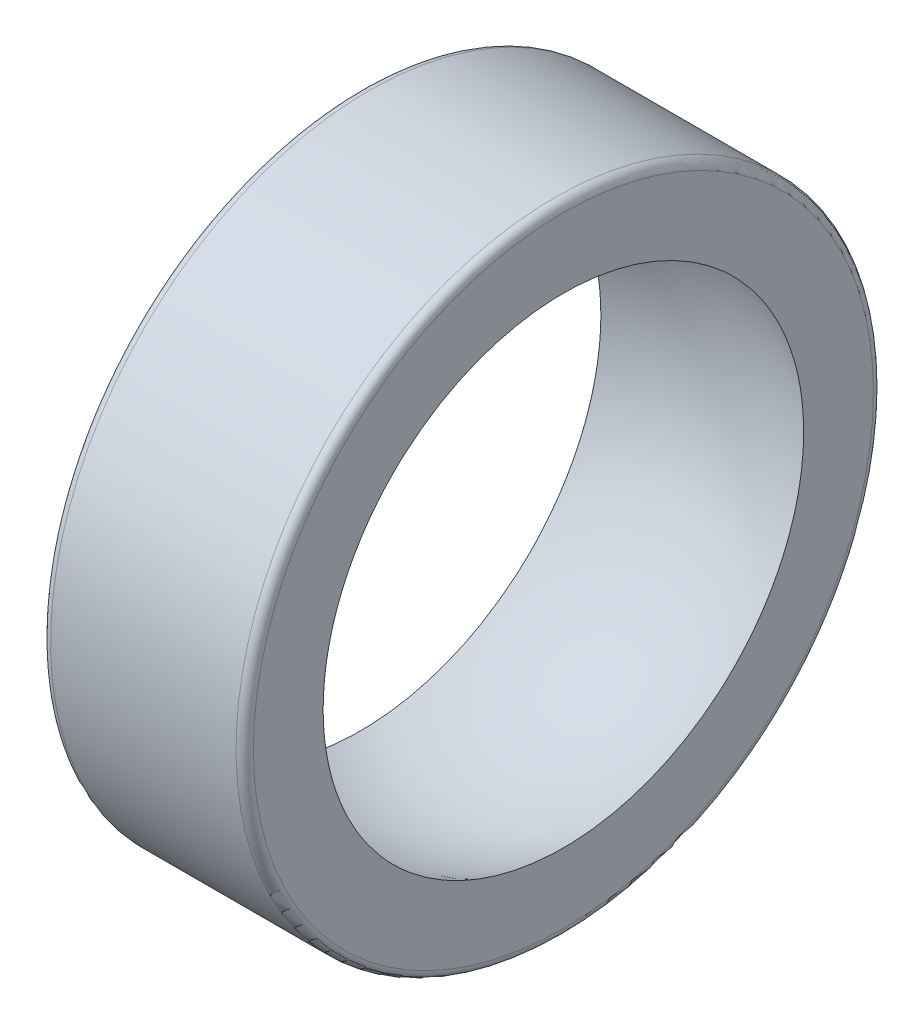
ISO-10303-21;
HEADER;
FILE_DESCRIPTION(('STEP AP214'),'2;1');
FILE_NAME('part.step','',(''),(''),'','','');
FILE_SCHEMA(('AUTOMOTIVE_DESIGN { 1 0 10303 214 1 1 1 1 }'));
ENDSEC;
DATA;
#1=APPLICATION_CONTEXT('core data for automotive mechanical design processes');
#2=APPLICATION_PROTOCOL_DEFINITION('international standard','automotive_design',2000,#1);
#3=PRODUCT_CONTEXT('',#1,'mechanical');
#4=PRODUCT('Part','Part','',(#3));
#5=PRODUCT_RELATED_PRODUCT_CATEGORY('part','',(#4));
#6=PRODUCT_DEFINITION_FORMATION('','',#4);
#7=PRODUCT_DEFINITION_CONTEXT('part definition',#1,'design');
#8=PRODUCT_DEFINITION('design','',#6,#7);
#9=PRODUCT_DEFINITION_SHAPE('','',#8);
#10=(LENGTH_UNIT() NAMED_UNIT(*) SI_UNIT(.MILLI.,.METRE.));
#11=(NAMED_UNIT(*) PLANE_ANGLE_UNIT() SI_UNIT($,.RADIAN.));
#12=(NAMED_UNIT(*) SI_UNIT($,.STERADIAN.) SOLID_ANGLE_UNIT());
#13=UNCERTAINTY_MEASURE_WITH_UNIT(LENGTH_MEASURE(1.E-05),#10,'distance_accuracy_value','');
#14=(GEOMETRIC_REPRESENTATION_CONTEXT(3) GLOBAL_UNCERTAINTY_ASSIGNED_CONTEXT((#13)) GLOBAL_UNIT_ASSIGNED_CONTEXT((#10,
#11,#12)) REPRESENTATION_CONTEXT('',''));
#15=CARTESIAN_POINT('',(0.,0.,0.));
#16=DIRECTION('',(0.,0.,1.));
#17=DIRECTION('',(1.,0.,0.));
#18=AXIS2_PLACEMENT_3D('',#15,#16,#17);
#19=CARTESIAN_POINT('',(5.00000000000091,0.,0.));
#20=DIRECTION('',(0.,0.,-1.));
#21=DIRECTION('',(0.,1.,0.));
#22=AXIS2_PLACEMENT_3D('',#19,#20,#21);
#23=SPHERICAL_SURFACE('',#22,8.99999999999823);
#24=CARTESIAN_POINT('',(5.00000000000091,0.,8.99999999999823));
#25=VERTEX_POINT('',#24);
#26=VERTEX_LOOP('',#25);
#27=FACE_BOUND('',#26,.T.);
#28=CARTESIAN_POINT('',(8.5,0.,8.29156197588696));
#29=CARTESIAN_POINT('',(8.5,0.23297256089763,8.2915641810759));
#30=CARTESIAN_POINT('',(8.5,0.465910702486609,8.28173948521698));
#31=CARTESIAN_POINT('',(8.5,0.930207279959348,8.24251101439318));
#32=CARTESIAN_POINT('',(8.5,1.16156532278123,8.2131025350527));
#33=CARTESIAN_POINT('',(8.5,1.62120377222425,8.13486970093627));
#34=CARTESIAN_POINT('',(8.5,1.84948093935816,8.0860263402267));
#35=CARTESIAN_POINT('',(8.5,2.30110981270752,7.96927173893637));
#36=CARTESIAN_POINT('',(8.5,2.52446146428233,7.90136028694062));
#37=CARTESIAN_POINT('',(8.5,2.9645458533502,7.74698782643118));
#38=CARTESIAN_POINT('',(8.5,3.18128153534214,7.6605352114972));
#39=CARTESIAN_POINT('',(8.5,3.60670177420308,7.46967571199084));
#40=CARTESIAN_POINT('',(8.5,3.81538621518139,7.36526856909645));
#41=CARTESIAN_POINT('',(8.5,4.22313338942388,7.13928942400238));
#42=CARTESIAN_POINT('',(8.5,4.42220000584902,7.01772442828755));
#43=CARTESIAN_POINT('',(8.5,4.80945514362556,6.75821630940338));
#44=CARTESIAN_POINT('',(8.5,4.99763987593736,6.62026753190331));
#45=CARTESIAN_POINT('',(8.5,5.36170245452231,6.32901918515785));
#46=CARTESIAN_POINT('',(8.5,5.5375813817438,6.17572096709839));
#47=CARTESIAN_POINT('',(8.5,5.87580380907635,5.85485002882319));
#48=CARTESIAN_POINT('',(8.5,6.03814702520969,5.68727700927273));
#49=CARTESIAN_POINT('',(8.5,6.34814207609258,5.3390479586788));
#50=CARTESIAN_POINT('',(8.5,6.49579369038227,5.15839173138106));
#51=CARTESIAN_POINT('',(8.5,6.77535596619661,4.78527895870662));
#52=CARTESIAN_POINT('',(8.5,6.90726629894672,4.5928221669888));
#53=CARTESIAN_POINT('',(8.5,7.15440124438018,4.19748533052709));
#54=CARTESIAN_POINT('',(8.5,7.26962630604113,3.99460556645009));
#55=CARTESIAN_POINT('',(8.5,7.48257575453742,3.57986037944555));
#56=CARTESIAN_POINT('',(8.5,7.58030014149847,3.36799495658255));
#57=CARTESIAN_POINT('',(8.5,7.75755413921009,2.93678307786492));
#58=CARTESIAN_POINT('',(8.5,7.83708361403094,2.71743656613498));
#59=CARTESIAN_POINT('',(8.5,7.97737996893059,2.27282811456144));
#60=CARTESIAN_POINT('',(8.5,8.038147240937,2.04756629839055));
#61=CARTESIAN_POINT('',(8.5,8.14049058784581,1.59271913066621));
#62=CARTESIAN_POINT('',(8.5,8.18206623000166,1.36313368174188));
#63=CARTESIAN_POINT('',(8.5,8.24572804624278,0.901281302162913));
#64=CARTESIAN_POINT('',(8.5,8.26781462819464,0.669014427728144));
#65=CARTESIAN_POINT('',(8.5,8.29234502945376,0.2034029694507));
#66=CARTESIAN_POINT('',(8.5,8.29478524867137,-0.0299418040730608));
#67=CARTESIAN_POINT('',(8.5,8.27999868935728,-0.495926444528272));
#68=CARTESIAN_POINT('',(8.5,8.26277871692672,-0.728566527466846));
#69=CARTESIAN_POINT('',(8.5,8.20880051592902,-1.19160991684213));
#70=CARTESIAN_POINT('',(8.5,8.17203889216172,-1.42201282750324));
#71=CARTESIAN_POINT('',(8.5,8.07923717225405,-1.87890011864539));
#72=CARTESIAN_POINT('',(8.5,8.02319729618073,-2.10538454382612));
#73=CARTESIAN_POINT('',(8.5,7.8922358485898,-2.55283269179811));
#74=CARTESIAN_POINT('',(8.5,7.81731383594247,-2.77379628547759));
#75=CARTESIAN_POINT('',(8.5,7.64912267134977,-3.20862310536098));
#76=CARTESIAN_POINT('',(8.5,7.55585378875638,-3.42248643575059));
#77=CARTESIAN_POINT('',(8.5,7.35161480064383,-3.84162949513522));
#78=CARTESIAN_POINT('',(8.5,7.24064184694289,-4.0469078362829));
#79=CARTESIAN_POINT('',(8.5,7.00182233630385,-4.44733809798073));
#80=CARTESIAN_POINT('',(8.5,6.87397969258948,-4.64249235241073));
#81=CARTESIAN_POINT('',(8.5,6.6023713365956,-5.0212524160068));
#82=CARTESIAN_POINT('',(8.5,6.45861285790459,-5.20486341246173));
#83=CARTESIAN_POINT('',(8.5,6.15600050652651,-5.55950046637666));
#84=CARTESIAN_POINT('',(8.5,5.99713219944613,-5.73051420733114));
#85=CARTESIAN_POINT('',(8.5,5.66565512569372,-6.05843790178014));
#86=CARTESIAN_POINT('',(8.5,5.49305529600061,-6.21535688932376));
#87=CARTESIAN_POINT('',(8.5,5.1351715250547,-6.5141676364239));
#88=CARTESIAN_POINT('',(8.5,4.94988189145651,-6.65605257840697));
#89=CARTESIAN_POINT('',(8.5,4.56801314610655,-6.92369977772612));
#90=CARTESIAN_POINT('',(8.5,4.37143445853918,-7.04946264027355));
#91=CARTESIAN_POINT('',(8.5,3.96847069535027,-7.28392432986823));
#92=CARTESIAN_POINT('',(8.5,3.76209009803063,-7.39263085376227));
#93=CARTESIAN_POINT('',(8.5,3.34054350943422,-7.5924482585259));
#94=CARTESIAN_POINT('',(8.5,3.12536297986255,-7.68352846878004));
#95=CARTESIAN_POINT('',(8.5,2.6882610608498,-7.84714362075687));
#96=CARTESIAN_POINT('',(8.5,2.4663452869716,-7.91969356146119));
#97=CARTESIAN_POINT('',(8.5,2.0175508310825,-8.0457276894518));
#98=CARTESIAN_POINT('',(8.5,1.79068059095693,-8.09924197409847));
#99=CARTESIAN_POINT('',(8.5,1.33328649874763,-8.18697396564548));
#100=CARTESIAN_POINT('',(8.5,1.10276375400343,-8.22119741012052));
#101=CARTESIAN_POINT('',(8.5,0.726569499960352,-8.26094890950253));
#102=CARTESIAN_POINT('',(8.5,0.581500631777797,-8.27242522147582));
#103=CARTESIAN_POINT('',(8.5,0.290960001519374,-8.2877321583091));
#104=CARTESIAN_POINT('',(8.5,0.145488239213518,-8.29156277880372));
#105=CARTESIAN_POINT('',(8.5,-0.232777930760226,-8.2915606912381));
#106=CARTESIAN_POINT('',(8.5,-0.465598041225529,-8.28175123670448));
#107=CARTESIAN_POINT('',(8.5,-0.92967875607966,-8.24257031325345));
#108=CARTESIAN_POINT('',(8.5,-1.16093853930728,-8.21318924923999));
#109=CARTESIAN_POINT('',(8.5,-1.62060509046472,-8.13499154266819));
#110=CARTESIAN_POINT('',(8.5,-1.84900563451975,-8.08613824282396));
#111=CARTESIAN_POINT('',(8.5,-2.30087624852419,-7.96934307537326));
#112=CARTESIAN_POINT('',(8.5,-2.52434621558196,-7.90140080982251));
#113=CARTESIAN_POINT('',(8.5,-2.96457487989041,-7.74697754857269));
#114=CARTESIAN_POINT('',(8.5,-3.18133907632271,-7.66051223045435));
#115=CARTESIAN_POINT('',(8.5,-3.60681723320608,-7.46962107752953));
#116=CARTESIAN_POINT('',(8.5,-3.81553094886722,-7.36519469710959));
#117=CARTESIAN_POINT('',(8.5,-4.22326634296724,-7.13920939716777));
#118=CARTESIAN_POINT('',(8.5,-4.42229504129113,-7.01766314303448));
#119=CARTESIAN_POINT('',(8.5,-4.80949337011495,-6.75818829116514));
#120=CARTESIAN_POINT('',(8.5,-4.99765835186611,-6.62025275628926));
#121=CARTESIAN_POINT('',(8.5,-5.3617179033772,-6.32900682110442));
#122=CARTESIAN_POINT('',(8.5,-5.53761126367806,-6.17569490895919));
#123=CARTESIAN_POINT('',(8.5,-5.87578467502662,-5.85486589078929));
#124=CARTESIAN_POINT('',(8.5,-6.03807047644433,-5.68735484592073));
#125=CARTESIAN_POINT('',(8.5,-6.34804182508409,-5.3391687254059));
#126=CARTESIAN_POINT('',(8.5,-6.49571955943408,-5.15848669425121));
#127=CARTESIAN_POINT('',(8.5,-6.77532423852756,-4.78532527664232));
#128=CARTESIAN_POINT('',(8.5,-6.90725141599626,-4.59284606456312));
#129=CARTESIAN_POINT('',(8.5,-7.15447054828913,-4.19737437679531));
#130=CARTESIAN_POINT('',(8.5,-7.26975560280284,-3.99437758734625));
#131=CARTESIAN_POINT('',(8.5,-7.48280374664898,-3.57939245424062));
#132=CARTESIAN_POINT('',(8.5,-7.58056701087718,-3.36740420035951));
#133=CARTESIAN_POINT('',(8.5,-7.75779017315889,-2.93615027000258));
#134=CARTESIAN_POINT('',(8.5,-7.83726807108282,-2.71689199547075));
#135=CARTESIAN_POINT('',(8.5,-7.97746027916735,-2.27253354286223));
#136=CARTESIAN_POINT('',(8.5,-8.03817909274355,-2.04743478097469));
#137=CARTESIAN_POINT('',(8.5,-8.15644596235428,-1.52179506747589));
#138=CARTESIAN_POINT('',(8.5,-8.20706766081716,-1.21967013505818));
#139=CARTESIAN_POINT('',(8.5,-8.27462422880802,-0.611677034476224));
#140=CARTESIAN_POINT('',(8.5,-8.29155908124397,-0.305808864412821));
#141=CARTESIAN_POINT('',(8.5,-8.29156418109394,0.232972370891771));
#142=CARTESIAN_POINT('',(8.5,-8.28173950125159,0.465910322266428));
#143=CARTESIAN_POINT('',(8.5,-8.2425110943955,0.930206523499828));
#144=CARTESIAN_POINT('',(8.5,-8.21310266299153,1.16156438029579));
#145=CARTESIAN_POINT('',(8.5,-8.13486987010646,1.62120296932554));
#146=CARTESIAN_POINT('',(8.5,-8.08602646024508,1.84948045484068));
#147=CARTESIAN_POINT('',(8.5,-7.96927177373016,2.30110969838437));
#148=CARTESIAN_POINT('',(8.5,-7.90136030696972,2.52446140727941));
#149=CARTESIAN_POINT('',(8.5,-7.74698648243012,2.96454968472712));
#150=CARTESIAN_POINT('',(8.5,-7.66053219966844,3.18128908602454));
#151=CARTESIAN_POINT('',(8.5,-7.46966873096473,3.60671649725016));
#152=CARTESIAN_POINT('',(8.5,-7.3652592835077,3.81540438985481));
#153=CARTESIAN_POINT('',(8.5,-7.1392833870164,4.22314286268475));
#154=CARTESIAN_POINT('',(8.5,-7.01772522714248,4.42219803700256));
#155=CARTESIAN_POINT('',(8.5,-6.7582223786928,4.80944686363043));
#156=CARTESIAN_POINT('',(8.5,-6.62027074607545,4.99763586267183));
#157=CARTESIAN_POINT('',(8.5,-6.3290031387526,5.36172250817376));
#158=CARTESIAN_POINT('',(8.5,-6.17568716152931,5.53762015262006));
#159=CARTESIAN_POINT('',(8.5,-5.85484934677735,5.8758013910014));
#160=CARTESIAN_POINT('',(8.5,-5.68733357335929,6.0380907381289));
#161=CARTESIAN_POINT('',(8.5,-5.33914617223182,6.34806057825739));
#162=CARTESIAN_POINT('',(8.5,-5.15846824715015,6.49573399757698));
#163=CARTESIAN_POINT('',(8.5,-4.78531563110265,6.77533084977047));
#164=CARTESIAN_POINT('',(8.5,-4.59284111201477,6.9072545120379));
#165=CARTESIAN_POINT('',(8.5,-4.19737517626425,7.15447004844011));
#166=CARTESIAN_POINT('',(8.5,-3.99437922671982,7.26975467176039));
#167=CARTESIAN_POINT('',(8.5,-3.5793958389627,7.48280209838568));
#168=CARTESIAN_POINT('',(8.5,-3.36740849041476,7.58056507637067));
#169=CARTESIAN_POINT('',(8.5,-2.93615467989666,7.75778853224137));
#170=CARTESIAN_POINT('',(8.5,-2.71689555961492,7.83726686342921));
#171=CARTESIAN_POINT('',(8.5,-2.27253536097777,7.97745978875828));
#172=CARTESIAN_POINT('',(8.5,-2.0474356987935,8.03817888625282));
#173=CARTESIAN_POINT('',(8.5,-1.52179481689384,8.15644601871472));
#174=CARTESIAN_POINT('',(8.5,-1.21966962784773,8.20706774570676));
#175=CARTESIAN_POINT('',(8.5,-0.611676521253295,8.27462425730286));
#176=CARTESIAN_POINT('',(8.5,-0.30580860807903,8.29155908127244));
#177=CARTESIAN_POINT('',(8.5,0.,8.29156197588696));
#178=B_SPLINE_CURVE_WITH_KNOTS('',3,(#28,#29,#30,#31,#32,#33,#34,#35,#36,#37,#38,#39,#40,#41,
#42,#43,#44,#45,#46,#47,#48,#49,#50,#51,#52,#53,#54,#55,#56,#57,#58,#59,#60,#61,#62,#63,#64,#65,
#66,#67,#68,#69,#70,#71,#72,#73,#74,#75,#76,#77,#78,#79,#80,#81,#82,#83,#84,#85,#86,#87,#88,#89,
#90,#91,#92,#93,#94,#95,#96,#97,#98,#99,#100,#101,#102,#103,#104,#105,#106,#107,#108,#109,#110,
#111,#112,#113,#114,#115,#116,#117,#118,#119,#120,#121,#122,#123,#124,#125,#126,#127,#128,#129,
#130,#131,#132,#133,#134,#135,#136,#137,#138,#139,#140,#141,#142,#143,#144,#145,#146,#147,#148,
#149,#150,#151,#152,#153,#154,#155,#156,#157,#158,#159,#160,#161,#162,#163,#164,#165,#166,#167,
#168,#169,#170,#171,#172,#173,#174,#175,#176,#177),.UNSPECIFIED.,.T.,.F.,(4,2,2,2,2,2,2,2,2,2,2,
2,2,2,2,2,2,2,2,2,2,2,2,2,2,2,2,2,2,2,2,2,2,2,2,2,2,2,2,2,2,2,2,2,2,2,2,2,2,2,2,2,2,2,2,2,2,2,2,
2,2,2,2,2,2,2,2,2,2,2,2,2,2,2,4),(0.,0.698651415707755,1.39747072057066,2.09697510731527,
2.79648725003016,3.49568338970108,4.194889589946,4.89381108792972,5.59297450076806,
6.29207642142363,6.99119300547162,7.6903200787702,8.38946175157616,9.08858460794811,
9.78770745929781,10.4868355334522,11.1859490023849,11.8850782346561,12.5841928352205,
13.2834355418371,13.9824362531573,14.6815584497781,15.380672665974,16.079803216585,
16.778923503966,17.4781563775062,18.1772273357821,18.8759818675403,19.5754107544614,
20.2743880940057,20.9736810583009,21.6729477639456,22.3718980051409,23.0720537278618,
23.7716409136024,24.4701170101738,25.1683852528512,25.6047664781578,26.0411479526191,
26.7393485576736,27.437891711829,28.1377561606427,28.8376352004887,29.5369241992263,
30.2362344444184,30.9350300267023,31.634122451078,32.3332836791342,33.0321479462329,
33.7313839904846,34.4306097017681,35.1301245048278,35.8296323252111,36.5284485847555,
37.2270969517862,38.1441735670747,39.0612506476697,39.7599014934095,40.458720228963,
41.1582255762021,41.8577378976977,42.5569462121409,43.256164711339,43.9550463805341,
44.6542251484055,45.3534040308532,46.0522858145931,46.7515041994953,47.4507123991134,
48.150224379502,48.8497293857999,49.5485484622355,50.2471996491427,51.1642770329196,
52.0813533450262),.UNSPECIFIED.);
#179=CARTESIAN_POINT('',(8.5,0.,8.29156197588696));
#180=VERTEX_POINT('',#179);
#181=EDGE_CURVE('E60',#180,#180,#178,.T.);
#182=ORIENTED_EDGE('',*,*,#181,.F.);
#183=EDGE_LOOP('',(#182));
#184=FACE_BOUND('',#183,.T.);
#185=CARTESIAN_POINT('',(1.5,0.,-8.2915619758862));
#186=CARTESIAN_POINT('',(1.5,0.232972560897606,-8.29156418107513));
#187=CARTESIAN_POINT('',(1.5,0.465910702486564,-8.28173948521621));
#188=CARTESIAN_POINT('',(1.5,0.930207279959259,-8.24251101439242));
#189=CARTESIAN_POINT('',(1.5,1.16156532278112,-8.21310253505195));
#190=CARTESIAN_POINT('',(1.5,1.6212037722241,-8.13486970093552));
#191=CARTESIAN_POINT('',(1.5,1.84948093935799,-8.08602634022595));
#192=CARTESIAN_POINT('',(1.5,2.3011098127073,-7.96927173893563));
#193=CARTESIAN_POINT('',(1.5,2.52446146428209,-7.90136028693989));
#194=CARTESIAN_POINT('',(1.5,2.96454585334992,-7.74698782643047));
#195=CARTESIAN_POINT('',(1.5,3.18128153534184,-7.6605352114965));
#196=CARTESIAN_POINT('',(1.5,3.60670177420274,-7.46967571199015));
#197=CARTESIAN_POINT('',(1.5,3.81538621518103,-7.36526856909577));
#198=CARTESIAN_POINT('',(1.5,4.22313338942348,-7.13928942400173));
#199=CARTESIAN_POINT('',(1.5,4.42220000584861,-7.0177244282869));
#200=CARTESIAN_POINT('',(1.5,4.80945514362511,-6.75821630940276));
#201=CARTESIAN_POINT('',(1.5,4.9976398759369,-6.6202675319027));
#202=CARTESIAN_POINT('',(1.5,5.36170245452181,-6.32901918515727));
#203=CARTESIAN_POINT('',(1.5,5.53758138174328,-6.17572096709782));
#204=CARTESIAN_POINT('',(1.5,5.8758038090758,-5.85485002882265));
#205=CARTESIAN_POINT('',(1.5,6.03814702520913,-5.68727700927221));
#206=CARTESIAN_POINT('',(1.5,6.34814207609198,-5.33904795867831));
#207=CARTESIAN_POINT('',(1.5,6.49579369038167,-5.15839173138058));
#208=CARTESIAN_POINT('',(1.5,6.77535596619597,-4.78527895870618));
#209=CARTESIAN_POINT('',(1.5,6.90726629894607,-4.59282216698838));
#210=CARTESIAN_POINT('',(1.5,7.15440124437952,-4.19748533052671));
#211=CARTESIAN_POINT('',(1.5,7.26962630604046,-3.99460556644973));
#212=CARTESIAN_POINT('',(1.5,7.48257575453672,-3.57986037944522));
#213=CARTESIAN_POINT('',(1.5,7.58030014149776,-3.36799495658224));
#214=CARTESIAN_POINT('',(1.5,7.75755413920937,-2.93678307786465));
#215=CARTESIAN_POINT('',(1.5,7.83708361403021,-2.71743656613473));
#216=CARTESIAN_POINT('',(1.5,7.97737996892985,-2.27282811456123));
#217=CARTESIAN_POINT('',(1.5,8.03814724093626,-2.04756629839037));
#218=CARTESIAN_POINT('',(1.5,8.14049058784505,-1.59271913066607));
#219=CARTESIAN_POINT('',(1.5,8.1820662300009,-1.36313368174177));
#220=CARTESIAN_POINT('',(1.5,8.24572804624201,-0.901281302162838));
#221=CARTESIAN_POINT('',(1.5,8.26781462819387,-0.66901442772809));
#222=CARTESIAN_POINT('',(1.5,8.292345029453,-0.20340296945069));
#223=CARTESIAN_POINT('',(1.5,8.29478524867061,0.0299418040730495));
#224=CARTESIAN_POINT('',(1.5,8.27999868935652,0.495926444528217));
#225=CARTESIAN_POINT('',(1.5,8.26277871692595,0.728566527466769));
#226=CARTESIAN_POINT('',(1.5,8.20880051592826,1.19160991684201));
#227=CARTESIAN_POINT('',(1.5,8.17203889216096,1.4220128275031));
#228=CARTESIAN_POINT('',(1.5,8.07923717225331,1.87890011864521));
#229=CARTESIAN_POINT('',(1.5,8.02319729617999,2.10538454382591));
#230=CARTESIAN_POINT('',(1.5,7.89223584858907,2.55283269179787));
#231=CARTESIAN_POINT('',(1.5,7.81731383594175,2.77379628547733));
#232=CARTESIAN_POINT('',(1.5,7.64912267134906,3.20862310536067));
#233=CARTESIAN_POINT('',(1.5,7.55585378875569,3.42248643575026));
#234=CARTESIAN_POINT('',(1.5,7.35161480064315,3.84162949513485));
#235=CARTESIAN_POINT('',(1.5,7.24064184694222,4.04690783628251));
#236=CARTESIAN_POINT('',(1.5,7.00182233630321,4.44733809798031));
#237=CARTESIAN_POINT('',(1.5,6.87397969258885,4.64249235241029));
#238=CARTESIAN_POINT('',(1.5,6.602371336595,5.02125241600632));
#239=CARTESIAN_POINT('',(1.5,6.458612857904,5.20486341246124));
#240=CARTESIAN_POINT('',(1.5,6.15600050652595,5.55950046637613));
#241=CARTESIAN_POINT('',(1.5,5.99713219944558,5.73051420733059));
#242=CARTESIAN_POINT('',(1.5,5.6656551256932,6.05843790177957));
#243=CARTESIAN_POINT('',(1.5,5.49305529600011,6.21535688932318));
#244=CARTESIAN_POINT('',(1.5,5.13517152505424,6.51416763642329));
#245=CARTESIAN_POINT('',(1.5,4.94988189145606,6.65605257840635));
#246=CARTESIAN_POINT('',(1.5,4.56801314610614,6.92369977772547));
#247=CARTESIAN_POINT('',(1.5,4.37143445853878,7.04946264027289));
#248=CARTESIAN_POINT('',(1.5,3.96847069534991,7.28392432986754));
#249=CARTESIAN_POINT('',(1.5,3.7620900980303,7.39263085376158));
#250=CARTESIAN_POINT('',(1.5,3.34054350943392,7.59244825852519));
#251=CARTESIAN_POINT('',(1.5,3.12536297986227,7.68352846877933));
#252=CARTESIAN_POINT('',(1.5,2.68826106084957,7.84714362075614));
#253=CARTESIAN_POINT('',(1.5,2.46634528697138,7.91969356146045));
#254=CARTESIAN_POINT('',(1.5,2.01755083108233,8.04572768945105));
#255=CARTESIAN_POINT('',(1.5,1.79068059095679,8.09924197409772));
#256=CARTESIAN_POINT('',(1.5,1.33328649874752,8.18697396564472));
#257=CARTESIAN_POINT('',(1.5,1.10276375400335,8.22119741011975));
#258=CARTESIAN_POINT('',(1.5,0.726569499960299,8.26094890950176));
#259=CARTESIAN_POINT('',(1.5,0.581500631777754,8.27242522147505));
#260=CARTESIAN_POINT('',(1.5,0.290960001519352,8.28773215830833));
#261=CARTESIAN_POINT('',(1.5,0.145488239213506,8.29156277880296));
#262=CARTESIAN_POINT('',(1.5,-0.232777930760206,8.29156069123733));
#263=CARTESIAN_POINT('',(1.5,-0.465598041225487,8.28175123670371));
#264=CARTESIAN_POINT('',(1.5,-0.929678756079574,8.24257031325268));
#265=CARTESIAN_POINT('',(1.5,-1.16093853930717,8.21318924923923));
#266=CARTESIAN_POINT('',(1.5,-1.62060509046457,8.13499154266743));
#267=CARTESIAN_POINT('',(1.5,-1.84900563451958,8.08613824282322));
#268=CARTESIAN_POINT('',(1.5,-2.30087624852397,7.96934307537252));
#269=CARTESIAN_POINT('',(1.5,-2.52434621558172,7.90140080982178));
#270=CARTESIAN_POINT('',(1.5,-2.96457487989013,7.74697754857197));
#271=CARTESIAN_POINT('',(1.5,-3.18133907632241,7.66051223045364));
#272=CARTESIAN_POINT('',(1.5,-3.60681723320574,7.46962107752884));
#273=CARTESIAN_POINT('',(1.5,-3.81553094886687,7.36519469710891));
#274=CARTESIAN_POINT('',(1.5,-4.22326634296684,7.13920939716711));
#275=CARTESIAN_POINT('',(1.5,-4.42229504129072,7.01766314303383));
#276=CARTESIAN_POINT('',(1.5,-4.8094933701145,6.75818829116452));
#277=CARTESIAN_POINT('',(1.5,-4.99765835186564,6.62025275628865));
#278=CARTESIAN_POINT('',(1.5,-5.3617179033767,6.32900682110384));
#279=CARTESIAN_POINT('',(1.5,-5.53761126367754,6.17569490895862));
#280=CARTESIAN_POINT('',(1.5,-5.87578467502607,5.85486589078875));
#281=CARTESIAN_POINT('',(1.5,-6.03807047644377,5.6873548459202));
#282=CARTESIAN_POINT('',(1.5,-6.3480418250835,5.33916872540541));
#283=CARTESIAN_POINT('',(1.5,-6.49571955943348,5.15848669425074));
#284=CARTESIAN_POINT('',(1.5,-6.77532423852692,4.78532527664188));
#285=CARTESIAN_POINT('',(1.5,-6.90725141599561,4.5928460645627));
#286=CARTESIAN_POINT('',(1.5,-7.15447054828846,4.19737437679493));
#287=CARTESIAN_POINT('',(1.5,-7.26975560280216,3.99437758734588));
#288=CARTESIAN_POINT('',(1.5,-7.48280374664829,3.57939245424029));
#289=CARTESIAN_POINT('',(1.5,-7.58056701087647,3.36740420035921));
#290=CARTESIAN_POINT('',(1.5,-7.75779017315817,2.93615027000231));
#291=CARTESIAN_POINT('',(1.5,-7.83726807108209,2.7168919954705));
#292=CARTESIAN_POINT('',(1.5,-7.97746027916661,2.27253354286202));
#293=CARTESIAN_POINT('',(1.5,-8.03817909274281,2.04743478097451));
#294=CARTESIAN_POINT('',(1.5,-8.15644596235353,1.52179506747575));
#295=CARTESIAN_POINT('',(1.5,-8.2070676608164,1.21967013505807));
#296=CARTESIAN_POINT('',(1.5,-8.27462422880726,0.611677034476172));
#297=CARTESIAN_POINT('',(1.5,-8.2915590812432,0.305808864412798));
#298=CARTESIAN_POINT('',(1.5,-8.29156418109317,-0.232972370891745));
#299=CARTESIAN_POINT('',(1.5,-8.28173950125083,-0.465910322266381));
#300=CARTESIAN_POINT('',(1.5,-8.24251109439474,-0.930206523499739));
#301=CARTESIAN_POINT('',(1.5,-8.21310266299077,-1.16156438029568));
#302=CARTESIAN_POINT('',(1.5,-8.13486987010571,-1.62120296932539));
#303=CARTESIAN_POINT('',(1.5,-8.08602646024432,-1.8494804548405));
#304=CARTESIAN_POINT('',(1.5,-7.96927177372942,-2.30110969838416));
#305=CARTESIAN_POINT('',(1.5,-7.90136030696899,-2.52446140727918));
#306=CARTESIAN_POINT('',(1.5,-7.7469864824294,-2.96454968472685));
#307=CARTESIAN_POINT('',(1.5,-7.66053219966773,-3.18128908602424));
#308=CARTESIAN_POINT('',(1.5,-7.46966873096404,-3.60671649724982));
#309=CARTESIAN_POINT('',(1.5,-7.36525928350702,-3.81540438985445));
#310=CARTESIAN_POINT('',(1.5,-7.13928338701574,-4.22314286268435));
#311=CARTESIAN_POINT('',(1.5,-7.01772522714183,-4.42219803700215));
#312=CARTESIAN_POINT('',(1.5,-6.75822237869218,-4.80944686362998));
#313=CARTESIAN_POINT('',(1.5,-6.62027074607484,-4.99763586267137));
#314=CARTESIAN_POINT('',(1.5,-6.32900313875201,-5.36172250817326));
#315=CARTESIAN_POINT('',(1.5,-6.17568716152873,-5.53762015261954));
#316=CARTESIAN_POINT('',(1.5,-5.85484934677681,-5.87580139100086));
#317=CARTESIAN_POINT('',(1.5,-5.68733357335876,-6.03809073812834));
#318=CARTESIAN_POINT('',(1.5,-5.33914617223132,-6.3480605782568));
#319=CARTESIAN_POINT('',(1.5,-5.15846824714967,-6.49573399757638));
#320=CARTESIAN_POINT('',(1.5,-4.7853156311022,-6.77533084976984));
#321=CARTESIAN_POINT('',(1.5,-4.59284111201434,-6.90725451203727));
#322=CARTESIAN_POINT('',(1.5,-4.19737517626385,-7.15447004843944));
#323=CARTESIAN_POINT('',(1.5,-3.99437922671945,-7.26975467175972));
#324=CARTESIAN_POINT('',(1.5,-3.57939583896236,-7.48280209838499));
#325=CARTESIAN_POINT('',(1.5,-3.36740849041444,-7.58056507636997));
#326=CARTESIAN_POINT('',(1.5,-2.93615467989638,-7.75778853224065));
#327=CARTESIAN_POINT('',(1.5,-2.71689555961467,-7.83726686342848));
#328=CARTESIAN_POINT('',(1.5,-2.27253536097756,-7.97745978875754));
#329=CARTESIAN_POINT('',(1.5,-2.0474356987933,-8.03817888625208));
#330=CARTESIAN_POINT('',(1.5,-1.5217948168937,-8.15644601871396));
#331=CARTESIAN_POINT('',(1.5,-1.21966962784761,-8.207067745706));
#332=CARTESIAN_POINT('',(1.5,-0.611676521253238,-8.27462425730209));
#333=CARTESIAN_POINT('',(1.5,-0.305808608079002,-8.29155908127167));
#334=CARTESIAN_POINT('',(1.5,0.,-8.2915619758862));
#335=B_SPLINE_CURVE_WITH_KNOTS('',3,(#185,#186,#187,#188,#189,#190,#191,#192,#193,#194,#195,
#196,#197,#198,#199,#200,#201,#202,#203,#204,#205,#206,#207,#208,#209,#210,#211,#212,#213,#214,
#215,#216,#217,#218,#219,#220,#221,#222,#223,#224,#225,#226,#227,#228,#229,#230,#231,#232,#233,
#234,#235,#236,#237,#238,#239,#240,#241,#242,#243,#244,#245,#246,#247,#248,#249,#250,#251,#252,
#253,#254,#255,#256,#257,#258,#259,#260,#261,#262,#263,#264,#265,#266,#267,#268,#269,#270,#271,
#272,#273,#274,#275,#276,#277,#278,#279,#280,#281,#282,#283,#284,#285,#286,#287,#288,#289,#290,
#291,#292,#293,#294,#295,#296,#297,#298,#299,#300,#301,#302,#303,#304,#305,#306,#307,#308,#309,
#310,#311,#312,#313,#314,#315,#316,#317,#318,#319,#320,#321,#322,#323,#324,#325,#326,#327,#328,
#329,#330,#331,#332,#333,#334),.UNSPECIFIED.,.T.,.F.,(4,2,2,2,2,2,2,2,2,2,2,2,2,2,2,2,2,2,2,2,2,
2,2,2,2,2,2,2,2,2,2,2,2,2,2,2,2,2,2,2,2,2,2,2,2,2,2,2,2,2,2,2,2,2,2,2,2,2,2,2,2,2,2,2,2,2,2,2,2,
2,2,2,2,2,4),(0.,0.698651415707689,1.39747072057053,2.09697510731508,2.79648725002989,
3.49568338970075,4.19488958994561,4.89381108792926,5.59297450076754,6.29207642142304,
6.99119300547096,7.69032007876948,8.38946175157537,9.08858460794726,9.78770745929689,
10.4868355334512,11.1859490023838,11.885078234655,12.5841928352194,13.2834355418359,
13.982436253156,14.6815584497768,15.3806726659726,16.0798032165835,16.7789235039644,
17.4781563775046,18.1772273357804,18.8759818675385,19.5754107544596,20.2743880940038,
20.973681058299,21.6729477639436,22.3718980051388,23.0720537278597,23.7716409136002,
24.4701170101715,25.1683852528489,25.6047664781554,26.0411479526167,26.7393485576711,
27.4378917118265,28.1377561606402,28.837635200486,29.5369241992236,30.2362344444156,
30.9350300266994,31.6341224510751,32.3332836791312,33.0321479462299,33.7313839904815,
34.4306097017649,35.1301245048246,35.8296323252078,36.5284485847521,37.2270969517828,
38.1441735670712,39.0612506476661,39.7599014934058,40.4587202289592,41.1582255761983,
41.8577378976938,42.556946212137,43.256164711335,43.95504638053,44.6542251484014,
45.353404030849,46.0522858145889,46.751504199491,47.450712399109,48.1502243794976,
48.8497293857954,49.5485484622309,50.2471996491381,51.1642770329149,52.0813533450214),.UNSPECIFIED.);
#336=CARTESIAN_POINT('',(1.5,0.,-8.2915619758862));
#337=VERTEX_POINT('',#336);
#338=EDGE_CURVE('E63',#337,#337,#335,.T.);
#339=ORIENTED_EDGE('',*,*,#338,.F.);
#340=EDGE_LOOP('',(#339));
#341=FACE_BOUND('',#340,.T.);
#342=CARTESIAN_POINT('',(5.00000000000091,0.,-8.99999999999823));
#343=VERTEX_POINT('',#342);
#344=VERTEX_LOOP('',#343);
#345=FACE_BOUND('',#344,.T.);
#346=ADVANCED_FACE('F16',(#27,#184,#341,#345),#23,.F.);
#347=CARTESIAN_POINT('',(8.5,8.2915619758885,0.));
#348=DIRECTION('',(1.,0.,0.));
#349=DIRECTION('',(0.,0.,-1.));
#350=AXIS2_PLACEMENT_3D('',#347,#348,#349);
#351=PLANE('',#350);
#352=ORIENTED_EDGE('',*,*,#181,.T.);
#353=EDGE_LOOP('',(#352));
#354=FACE_BOUND('',#353,.T.);
#355=CARTESIAN_POINT('',(8.5,0.,0.));
#356=DIRECTION('',(-1.,0.,0.));
#357=DIRECTION('',(0.,-1.,0.));
#358=AXIS2_PLACEMENT_3D('',#355,#356,#357);
#359=CIRCLE('',#358,10.7000000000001);
#360=CARTESIAN_POINT('',(8.5,-10.7000000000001,0.));
#361=VERTEX_POINT('',#360);
#362=CARTESIAN_POINT('',(8.5,0.,10.7));
#363=VERTEX_POINT('',#362);
#364=EDGE_CURVE('E156',#361,#363,#359,.T.);
#365=ORIENTED_EDGE('',*,*,#364,.F.);
#366=CARTESIAN_POINT('',(8.5,0.,0.));
#367=DIRECTION('',(-1.,0.,0.));
#368=DIRECTION('',(0.,1.,0.));
#369=AXIS2_PLACEMENT_3D('',#366,#367,#368);
#370=CIRCLE('',#369,10.7000000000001);
#371=CARTESIAN_POINT('',(8.5,10.7000000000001,0.));
#372=VERTEX_POINT('',#371);
#373=EDGE_CURVE('E169',#372,#361,#370,.T.);
#374=ORIENTED_EDGE('',*,*,#373,.F.);
#375=CARTESIAN_POINT('',(8.5,0.,0.));
#376=DIRECTION('',(-1.,0.,0.));
#377=DIRECTION('',(0.,0.,1.));
#378=AXIS2_PLACEMENT_3D('',#375,#376,#377);
#379=CIRCLE('',#378,10.7);
#380=EDGE_CURVE('E166',#363,#372,#379,.T.);
#381=ORIENTED_EDGE('',*,*,#380,.F.);
#382=EDGE_LOOP('',(#365,#374,#381));
#383=FACE_BOUND('',#382,.T.);
#384=ADVANCED_FACE('F56',(#354,#383),#351,.T.);
#385=CARTESIAN_POINT('',(1.5,10.7,0.));
#386=DIRECTION('',(-1.,0.,0.));
#387=DIRECTION('',(0.,0.,1.));
#388=AXIS2_PLACEMENT_3D('',#385,#386,#387);
#389=PLANE('',#388);
#390=CARTESIAN_POINT('',(1.5,0.,0.));
#391=DIRECTION('',(1.,0.,0.));
#392=DIRECTION('',(0.,-1.,0.));
#393=AXIS2_PLACEMENT_3D('',#390,#391,#392);
#394=CIRCLE('',#393,10.7000000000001);
#395=CARTESIAN_POINT('',(1.5,-10.7000000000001,0.));
#396=VERTEX_POINT('',#395);
#397=CARTESIAN_POINT('',(1.5,10.7000000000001,0.));
#398=VERTEX_POINT('',#397);
#399=EDGE_CURVE('E112',#396,#398,#394,.T.);
#400=ORIENTED_EDGE('',*,*,#399,.F.);
#401=CARTESIAN_POINT('',(1.5,0.,0.));
#402=DIRECTION('',(1.,0.,0.));
#403=DIRECTION('',(0.,0.,1.));
#404=AXIS2_PLACEMENT_3D('',#401,#402,#403);
#405=CIRCLE('',#404,10.7);
#406=CARTESIAN_POINT('',(1.5,0.,10.7));
#407=VERTEX_POINT('',#406);
#408=EDGE_CURVE('E38',#407,#396,#405,.T.);
#409=ORIENTED_EDGE('',*,*,#408,.F.);
#410=CARTESIAN_POINT('',(1.5,0.,0.));
#411=DIRECTION('',(1.,0.,0.));
#412=DIRECTION('',(0.,1.,0.));
#413=AXIS2_PLACEMENT_3D('',#410,#411,#412);
#414=CIRCLE('',#413,10.7000000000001);
#415=EDGE_CURVE('E65',#398,#407,#414,.T.);
#416=ORIENTED_EDGE('',*,*,#415,.F.);
#417=EDGE_LOOP('',(#400,#409,#416));
#418=FACE_BOUND('',#417,.T.);
#419=ORIENTED_EDGE('',*,*,#338,.T.);
#420=EDGE_LOOP('',(#419));
#421=FACE_BOUND('',#420,.T.);
#422=ADVANCED_FACE('F76',(#418,#421),#389,.T.);
#423=CARTESIAN_POINT('',(8.20000000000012,0.,0.));
#424=DIRECTION('',(1.,0.,0.));
#425=DIRECTION('',(0.,-1.,0.));
#426=AXIS2_PLACEMENT_3D('',#423,#424,#425);
#427=TOROIDAL_SURFACE('',#426,10.7000000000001,0.299999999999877);
#428=ORIENTED_EDGE('',*,*,#380,.T.);
#429=ORIENTED_EDGE('',*,*,#373,.T.);
#430=ORIENTED_EDGE('',*,*,#364,.T.);
#431=EDGE_LOOP('',(#428,#429,#430));
#432=FACE_BOUND('',#431,.T.);
#433=CARTESIAN_POINT('',(8.2,0.,0.));
#434=DIRECTION('',(1.,0.,0.));
#435=DIRECTION('',(0.,0.,-1.));
#436=AXIS2_PLACEMENT_3D('',#433,#434,#435);
#437=CIRCLE('',#436,11.);
#438=CARTESIAN_POINT('',(8.2,0.,-11.));
#439=VERTEX_POINT('',#438);
#440=EDGE_CURVE('E10',#439,#439,#437,.F.);
#441=ORIENTED_EDGE('',*,*,#440,.F.);
#442=EDGE_LOOP('',(#441));
#443=FACE_BOUND('',#442,.T.);
#444=ADVANCED_FACE('F79',(#432,#443),#427,.T.);
#445=CARTESIAN_POINT('',(1.79999999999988,0.,0.));
#446=DIRECTION('',(1.,0.,0.));
#447=DIRECTION('',(0.,-1.,0.));
#448=AXIS2_PLACEMENT_3D('',#445,#446,#447);
#449=TOROIDAL_SURFACE('',#448,10.7000000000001,0.299999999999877);
#450=CARTESIAN_POINT('',(1.8,0.,0.));
#451=DIRECTION('',(1.,0.,0.));
#452=DIRECTION('',(0.,0.,-1.));
#453=AXIS2_PLACEMENT_3D('',#450,#451,#452);
#454=CIRCLE('',#453,11.);
#455=CARTESIAN_POINT('',(1.8,0.,-11.));
#456=VERTEX_POINT('',#455);
#457=EDGE_CURVE('E29',#456,#456,#454,.T.);
#458=ORIENTED_EDGE('',*,*,#457,.F.);
#459=EDGE_LOOP('',(#458));
#460=FACE_BOUND('',#459,.T.);
#461=ORIENTED_EDGE('',*,*,#399,.T.);
#462=ORIENTED_EDGE('',*,*,#415,.T.);
#463=ORIENTED_EDGE('',*,*,#408,.T.);
#464=EDGE_LOOP('',(#461,#462,#463));
#465=FACE_BOUND('',#464,.T.);
#466=ADVANCED_FACE('F117',(#460,#465),#449,.T.);
#467=CARTESIAN_POINT('',(50.,0.,0.));
#468=DIRECTION('',(1.,0.,0.));
#469=DIRECTION('',(0.,0.,-1.));
#470=AXIS2_PLACEMENT_3D('',#467,#468,#469);
#471=CYLINDRICAL_SURFACE('',#470,11.);
#472=ORIENTED_EDGE('',*,*,#440,.T.);
#473=EDGE_LOOP('',(#472));
#474=FACE_BOUND('',#473,.T.);
#475=ORIENTED_EDGE('',*,*,#457,.T.);
#476=EDGE_LOOP('',(#475));
#477=FACE_BOUND('',#476,.T.);
#478=ADVANCED_FACE('F127',(#474,#477),#471,.T.);
#479=CLOSED_SHELL('',(#346,#384,#422,#444,#466,#478));
#480=MANIFOLD_SOLID_BREP('B1',#479);
#481=ADVANCED_BREP_SHAPE_REPRESENTATION('',(#18,#480),#14);
#482=SHAPE_DEFINITION_REPRESENTATION(#9,#481);
ENDSEC;
END-ISO-10303-21;
